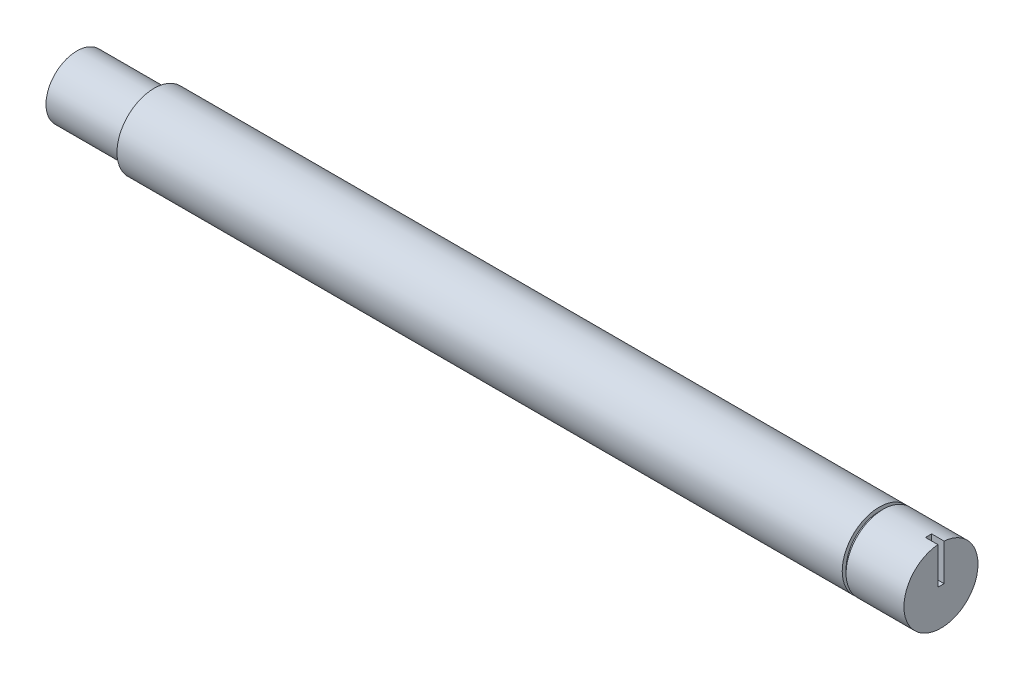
from build123d import *

# Parameters (mm, degrees)
SKETCH1_R          = 7.62
BASE_EXTRUDE_DEPTH = 177.8
CUT_EXTRUDE1_START = -0.79375
SKETCH2_R          = 7.62
SKETCH2_R_2        = 6.82625
CUT_EXTRUDE1_DEPTH = 0.79375
SKETCH3_R          = 7.62
SKETCH3_R_2        = 6.35
CUT_EXTRUDE2_DEPTH = 15.875
CUT_EXTRUDE3_START = -2.54
CUT_EXTRUDE3_DEPTH = 2.54


with BuildPart() as part:
    # Sketch1 → Base-Extrude (new body)
    with BuildSketch(Plane(origin=(0, 0, 0), x_dir=(0, 0, -1), z_dir=(1, 0, 0))):
        Circle(SKETCH1_R)
    extrude(amount=BASE_EXTRUDE_DEPTH)

    # Sketch2 → Cut-Extrude1 (cut)
    with BuildSketch(Plane(origin=(165.89375, 0, 0), x_dir=(0, 0, -1), z_dir=(1, 0, 0)).offset(CUT_EXTRUDE1_START)):
        Circle(SKETCH2_R)
        Circle(SKETCH2_R_2, mode=Mode.SUBTRACT)
    extrude(amount=CUT_EXTRUDE1_DEPTH, mode=Mode.SUBTRACT)

    # Sketch3 → Cut-Extrude2 (cut)
    with BuildSketch(Plane.ZY):
        Circle(SKETCH3_R)
        Circle(SKETCH3_R_2, mode=Mode.SUBTRACT)
    extrude(amount=-CUT_EXTRUDE2_DEPTH, mode=Mode.SUBTRACT)

    # Sketch4 → Cut-Extrude3 (cut)
    with BuildSketch(Plane(origin=(177.8, 0, 0), x_dir=(0, 0, -1), z_dir=(1, 0, 0)).offset(CUT_EXTRUDE3_START)):
        with BuildLine():
            Line((-0.635, 0), (0.635, 0))
            Line((0.635, 0), (0.635, 7.593495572))
            ThreePointArc((0.635, 7.593495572), (0, 7.62), (-0.635, 7.593495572))
            Line((-0.635, 7.593495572), (-0.635, 0))
        make_face()
    extrude(amount=CUT_EXTRUDE3_DEPTH, mode=Mode.SUBTRACT)


solid = part.part
